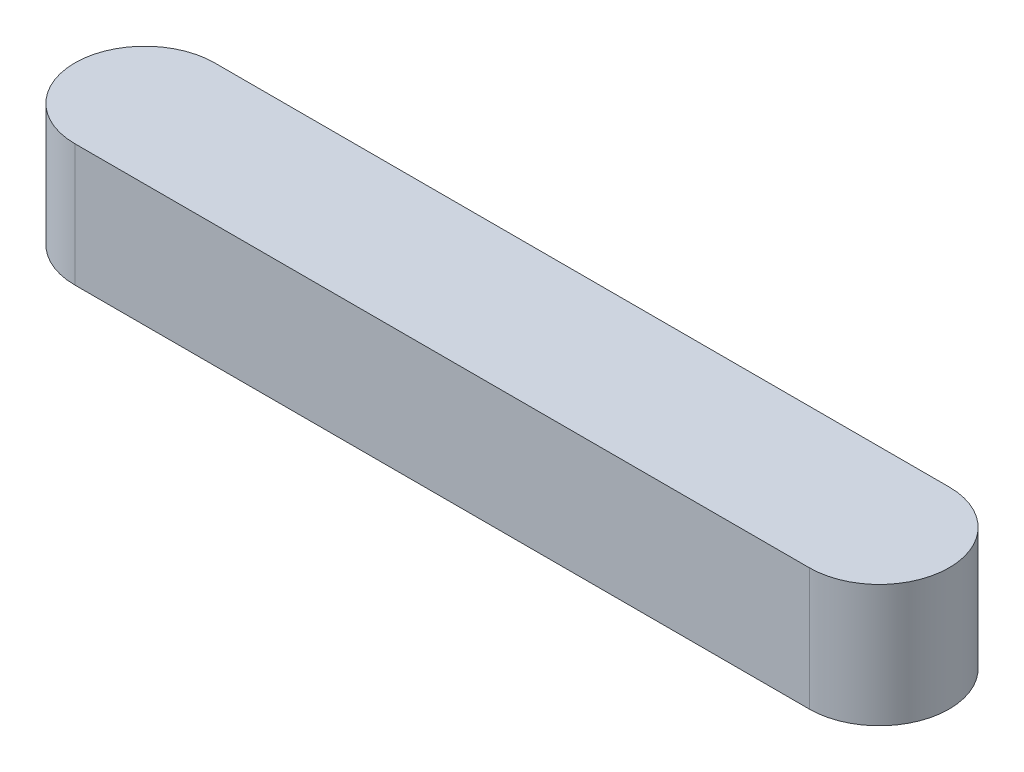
ISO-10303-21;
HEADER;
FILE_DESCRIPTION(('STEP AP214'),'2;1');
FILE_NAME('part.step','',(''),(''),'','','');
FILE_SCHEMA(('AUTOMOTIVE_DESIGN { 1 0 10303 214 1 1 1 1 }'));
ENDSEC;
DATA;
#1=APPLICATION_CONTEXT('core data for automotive mechanical design processes');
#2=APPLICATION_PROTOCOL_DEFINITION('international standard','automotive_design',2000,#1);
#3=PRODUCT_CONTEXT('',#1,'mechanical');
#4=PRODUCT('Part','Part','',(#3));
#5=PRODUCT_RELATED_PRODUCT_CATEGORY('part','',(#4));
#6=PRODUCT_DEFINITION_FORMATION('','',#4);
#7=PRODUCT_DEFINITION_CONTEXT('part definition',#1,'design');
#8=PRODUCT_DEFINITION('design','',#6,#7);
#9=PRODUCT_DEFINITION_SHAPE('','',#8);
#10=(LENGTH_UNIT() NAMED_UNIT(*) SI_UNIT(.MILLI.,.METRE.));
#11=(NAMED_UNIT(*) PLANE_ANGLE_UNIT() SI_UNIT($,.RADIAN.));
#12=(NAMED_UNIT(*) SI_UNIT($,.STERADIAN.) SOLID_ANGLE_UNIT());
#13=UNCERTAINTY_MEASURE_WITH_UNIT(LENGTH_MEASURE(1.E-05),#10,'distance_accuracy_value','');
#14=(GEOMETRIC_REPRESENTATION_CONTEXT(3) GLOBAL_UNCERTAINTY_ASSIGNED_CONTEXT((#13)) GLOBAL_UNIT_ASSIGNED_CONTEXT((#10,
#11,#12)) REPRESENTATION_CONTEXT('',''));
#15=CARTESIAN_POINT('',(0.,0.,0.));
#16=DIRECTION('',(0.,0.,1.));
#17=DIRECTION('',(1.,0.,0.));
#18=AXIS2_PLACEMENT_3D('',#15,#16,#17);
#19=CARTESIAN_POINT('',(42.,7.,0.));
#20=DIRECTION('',(0.,-1.,0.));
#21=DIRECTION('',(0.,0.,-1.));
#22=AXIS2_PLACEMENT_3D('',#19,#20,#21);
#23=CYLINDRICAL_SURFACE('',#22,4.00000000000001);
#24=CARTESIAN_POINT('',(42.,0.,0.));
#25=DIRECTION('',(0.,1.,0.));
#26=DIRECTION('',(0.,0.,1.));
#27=AXIS2_PLACEMENT_3D('',#24,#25,#26);
#28=CIRCLE('',#27,4.00000000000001);
#29=CARTESIAN_POINT('',(42.,0.,4.00000000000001));
#30=VERTEX_POINT('',#29);
#31=CARTESIAN_POINT('',(42.,0.,-4.00000000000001));
#32=VERTEX_POINT('',#31);
#33=EDGE_CURVE('E95',#30,#32,#28,.T.);
#34=ORIENTED_EDGE('',*,*,#33,.T.);
#35=DIRECTION('',(0.,-1.,0.));
#36=VECTOR('',#35,1.);
#37=CARTESIAN_POINT('',(42.,7.,-4.00000000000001));
#38=LINE('',#37,#36);
#39=CARTESIAN_POINT('',(42.,7.,-4.00000000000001));
#40=VERTEX_POINT('',#39);
#41=EDGE_CURVE('E11',#40,#32,#38,.T.);
#42=ORIENTED_EDGE('',*,*,#41,.F.);
#43=CARTESIAN_POINT('',(42.,7.,0.));
#44=DIRECTION('',(0.,1.,0.));
#45=DIRECTION('',(0.,0.,1.));
#46=AXIS2_PLACEMENT_3D('',#43,#44,#45);
#47=CIRCLE('',#46,4.00000000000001);
#48=CARTESIAN_POINT('',(42.,7.,4.00000000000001));
#49=VERTEX_POINT('',#48);
#50=EDGE_CURVE('E83',#49,#40,#47,.T.);
#51=ORIENTED_EDGE('',*,*,#50,.F.);
#52=DIRECTION('',(0.,-1.,0.));
#53=VECTOR('',#52,1.);
#54=CARTESIAN_POINT('',(42.,7.,4.00000000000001));
#55=LINE('',#54,#53);
#56=EDGE_CURVE('E91',#49,#30,#55,.T.);
#57=ORIENTED_EDGE('',*,*,#56,.T.);
#58=EDGE_LOOP('',(#34,#42,#51,#57));
#59=FACE_BOUND('',#58,.T.);
#60=ADVANCED_FACE('F32',(#59),#23,.T.);
#61=CARTESIAN_POINT('',(42.,7.,-4.00000000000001));
#62=DIRECTION('',(0.,0.,1.));
#63=DIRECTION('',(1.,0.,0.));
#64=AXIS2_PLACEMENT_3D('',#61,#62,#63);
#65=PLANE('',#64);
#66=DIRECTION('',(-1.,0.,0.));
#67=VECTOR('',#66,1.);
#68=CARTESIAN_POINT('',(42.,0.,-4.00000000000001));
#69=LINE('',#68,#67);
#70=CARTESIAN_POINT('',(0.,0.,-4.00000000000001));
#71=VERTEX_POINT('',#70);
#72=EDGE_CURVE('E87',#32,#71,#69,.T.);
#73=ORIENTED_EDGE('',*,*,#72,.T.);
#74=DIRECTION('',(0.,-1.,0.));
#75=VECTOR('',#74,1.);
#76=CARTESIAN_POINT('',(0.,7.,-4.00000000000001));
#77=LINE('',#76,#75);
#78=CARTESIAN_POINT('',(0.,7.,-4.00000000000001));
#79=VERTEX_POINT('',#78);
#80=EDGE_CURVE('E40',#79,#71,#77,.T.);
#81=ORIENTED_EDGE('',*,*,#80,.F.);
#82=DIRECTION('',(-1.,0.,0.));
#83=VECTOR('',#82,1.);
#84=CARTESIAN_POINT('',(42.,7.,-4.00000000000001));
#85=LINE('',#84,#83);
#86=EDGE_CURVE('E78',#40,#79,#85,.T.);
#87=ORIENTED_EDGE('',*,*,#86,.F.);
#88=ORIENTED_EDGE('',*,*,#41,.T.);
#89=EDGE_LOOP('',(#73,#81,#87,#88));
#90=FACE_BOUND('',#89,.T.);
#91=ADVANCED_FACE('F86',(#90),#65,.F.);
#92=CARTESIAN_POINT('',(0.,7.,0.));
#93=DIRECTION('',(0.,-1.,0.));
#94=DIRECTION('',(0.,0.,-1.));
#95=AXIS2_PLACEMENT_3D('',#92,#93,#94);
#96=CYLINDRICAL_SURFACE('',#95,4.00000000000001);
#97=CARTESIAN_POINT('',(0.,0.,0.));
#98=DIRECTION('',(0.,1.,0.));
#99=DIRECTION('',(0.,0.,1.));
#100=AXIS2_PLACEMENT_3D('',#97,#98,#99);
#101=CIRCLE('',#100,4.00000000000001);
#102=CARTESIAN_POINT('',(0.,0.,4.00000000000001));
#103=VERTEX_POINT('',#102);
#104=EDGE_CURVE('E65',#71,#103,#101,.T.);
#105=ORIENTED_EDGE('',*,*,#104,.T.);
#106=DIRECTION('',(0.,-1.,0.));
#107=VECTOR('',#106,1.);
#108=CARTESIAN_POINT('',(0.,7.,4.00000000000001));
#109=LINE('',#108,#107);
#110=CARTESIAN_POINT('',(0.,7.,4.00000000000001));
#111=VERTEX_POINT('',#110);
#112=EDGE_CURVE('E88',#111,#103,#109,.T.);
#113=ORIENTED_EDGE('',*,*,#112,.F.);
#114=CARTESIAN_POINT('',(0.,7.,0.));
#115=DIRECTION('',(0.,1.,0.));
#116=DIRECTION('',(0.,0.,1.));
#117=AXIS2_PLACEMENT_3D('',#114,#115,#116);
#118=CIRCLE('',#117,4.00000000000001);
#119=EDGE_CURVE('E81',#79,#111,#118,.T.);
#120=ORIENTED_EDGE('',*,*,#119,.F.);
#121=ORIENTED_EDGE('',*,*,#80,.T.);
#122=EDGE_LOOP('',(#105,#113,#120,#121));
#123=FACE_BOUND('',#122,.T.);
#124=ADVANCED_FACE('F89',(#123),#96,.T.);
#125=CARTESIAN_POINT('',(0.,7.,4.00000000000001));
#126=DIRECTION('',(0.,0.,-1.));
#127=DIRECTION('',(-1.,0.,0.));
#128=AXIS2_PLACEMENT_3D('',#125,#126,#127);
#129=PLANE('',#128);
#130=DIRECTION('',(1.,0.,0.));
#131=VECTOR('',#130,1.);
#132=CARTESIAN_POINT('',(0.,0.,4.00000000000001));
#133=LINE('',#132,#131);
#134=EDGE_CURVE('E71',#103,#30,#133,.T.);
#135=ORIENTED_EDGE('',*,*,#134,.T.);
#136=ORIENTED_EDGE('',*,*,#56,.F.);
#137=DIRECTION('',(1.,0.,0.));
#138=VECTOR('',#137,1.);
#139=CARTESIAN_POINT('',(0.,7.,4.00000000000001));
#140=LINE('',#139,#138);
#141=EDGE_CURVE('E48',#111,#49,#140,.T.);
#142=ORIENTED_EDGE('',*,*,#141,.F.);
#143=ORIENTED_EDGE('',*,*,#112,.T.);
#144=EDGE_LOOP('',(#135,#136,#142,#143));
#145=FACE_BOUND('',#144,.T.);
#146=ADVANCED_FACE('F102',(#145),#129,.F.);
#147=CARTESIAN_POINT('',(42.,7.,0.));
#148=DIRECTION('',(0.,1.,0.));
#149=DIRECTION('',(0.,0.,1.));
#150=AXIS2_PLACEMENT_3D('',#147,#148,#149);
#151=PLANE('',#150);
#152=ORIENTED_EDGE('',*,*,#50,.T.);
#153=ORIENTED_EDGE('',*,*,#86,.T.);
#154=ORIENTED_EDGE('',*,*,#119,.T.);
#155=ORIENTED_EDGE('',*,*,#141,.T.);
#156=EDGE_LOOP('',(#152,#153,#154,#155));
#157=FACE_BOUND('',#156,.T.);
#158=ADVANCED_FACE('F79',(#157),#151,.T.);
#159=CARTESIAN_POINT('',(42.,0.,0.));
#160=DIRECTION('',(0.,1.,0.));
#161=DIRECTION('',(0.,0.,1.));
#162=AXIS2_PLACEMENT_3D('',#159,#160,#161);
#163=PLANE('',#162);
#164=ORIENTED_EDGE('',*,*,#33,.F.);
#165=ORIENTED_EDGE('',*,*,#134,.F.);
#166=ORIENTED_EDGE('',*,*,#104,.F.);
#167=ORIENTED_EDGE('',*,*,#72,.F.);
#168=EDGE_LOOP('',(#164,#165,#166,#167));
#169=FACE_BOUND('',#168,.T.);
#170=ADVANCED_FACE('F105',(#169),#163,.F.);
#171=CLOSED_SHELL('',(#60,#91,#124,#146,#158,#170));
#172=MANIFOLD_SOLID_BREP('B2',#171);
#173=ADVANCED_BREP_SHAPE_REPRESENTATION('',(#18,#172),#14);
#174=SHAPE_DEFINITION_REPRESENTATION(#9,#173);
ENDSEC;
END-ISO-10303-21;
